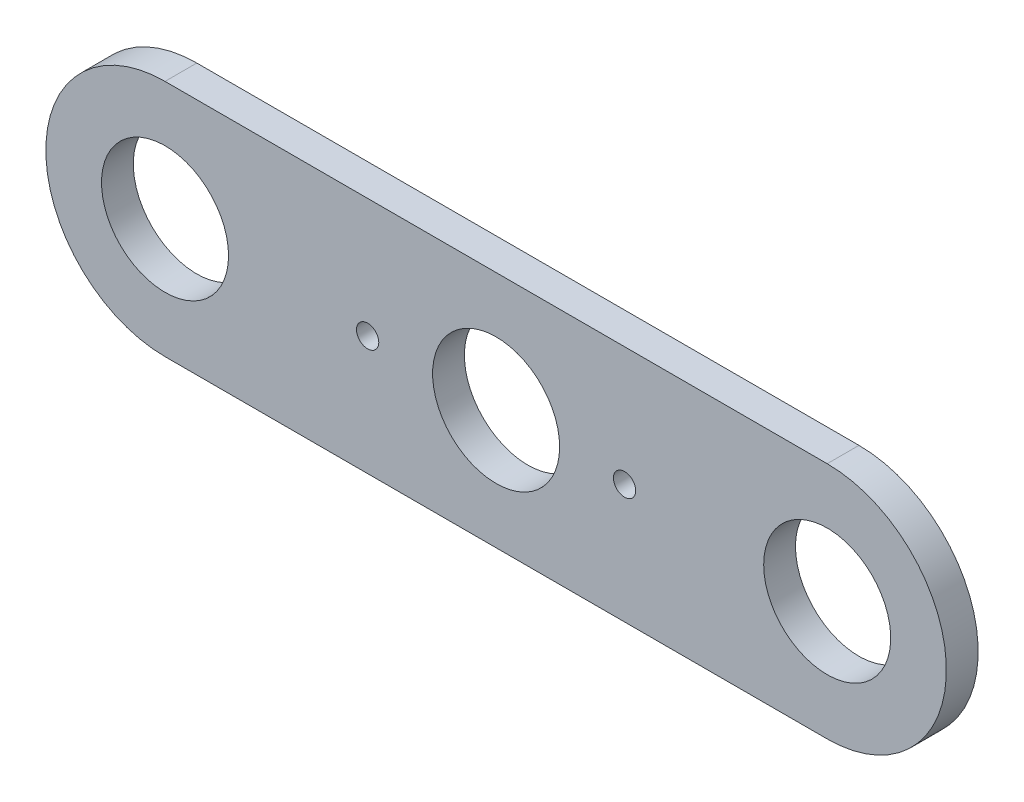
from build123d import *

# Parameters (mm, degrees)
SKETCH2_R           = 11.99
BOSS_EXTRUDE1_DEPTH = 6
SKETCH3_R           = 2.1
CUT_EXTRUDE1_DEPTH  = 10


with BuildPart() as part:
    # Sketch2 → Boss-Extrude1 (new body)
    with BuildSketch(Plane.XY):
        with BuildLine():
            Line((-62.5, -22.5), (62.5, -22.5))
            ThreePointArc((62.5, -22.5), (85, 0), (62.5, 22.5))
            Line((62.5, 22.5), (-62.5, 22.5))
            ThreePointArc((-62.5, 22.5), (-85, 0), (-62.5, -22.5))
        make_face()
        with Locations((-62.5, 0)):
            Circle(SKETCH2_R, mode=Mode.SUBTRACT)
        with Locations(Location((62.5, 0, 0), (0, 0, 180))):
            Circle(SKETCH2_R, mode=Mode.SUBTRACT)
        Circle(SKETCH2_R, mode=Mode.SUBTRACT)
    extrude(amount=BOSS_EXTRUDE1_DEPTH)

    # Sketch3 → Cut-Extrude1 (cut)
    with BuildSketch(Plane.XY.offset(6)):
        with Locations((-24.25, 0)):
            Circle(SKETCH3_R)
        with Locations((24.25, 0)):
            Circle(SKETCH3_R)
    extrude(amount=-CUT_EXTRUDE1_DEPTH, mode=Mode.SUBTRACT)


solid = part.part
